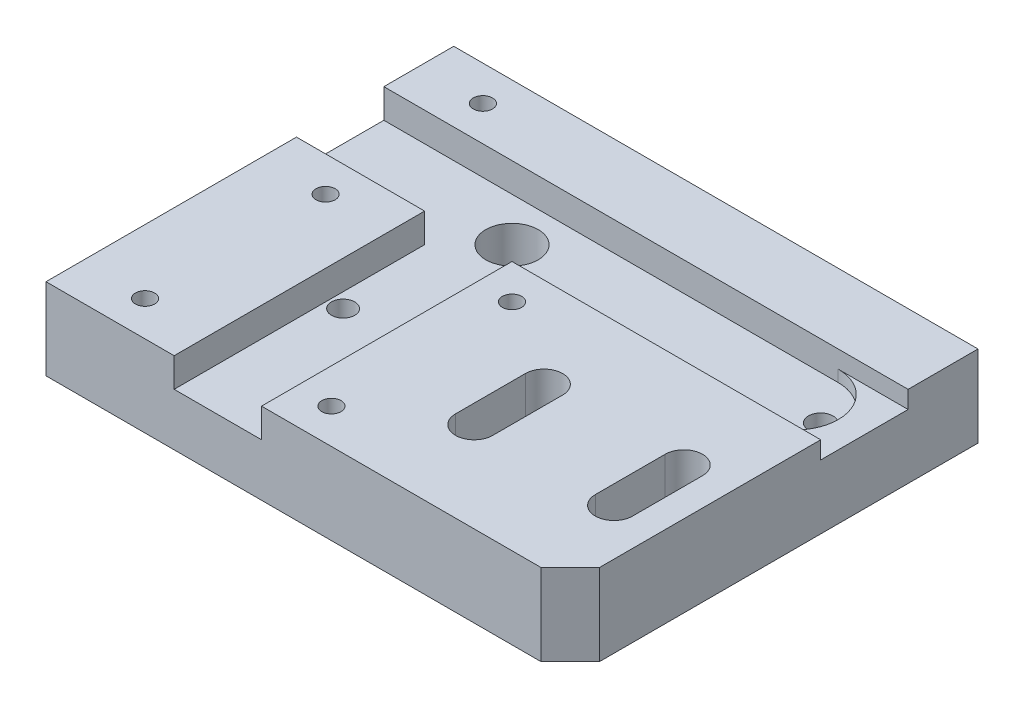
ISO-10303-21;
HEADER;
FILE_DESCRIPTION(('STEP AP214'),'2;1');
FILE_NAME('part.step','',(''),(''),'','','');
FILE_SCHEMA(('AUTOMOTIVE_DESIGN { 1 0 10303 214 1 1 1 1 }'));
ENDSEC;
DATA;
#1=APPLICATION_CONTEXT('core data for automotive mechanical design processes');
#2=APPLICATION_PROTOCOL_DEFINITION('international standard','automotive_design',2000,#1);
#3=PRODUCT_CONTEXT('',#1,'mechanical');
#4=PRODUCT('Part','Part','',(#3));
#5=PRODUCT_RELATED_PRODUCT_CATEGORY('part','',(#4));
#6=PRODUCT_DEFINITION_FORMATION('','',#4);
#7=PRODUCT_DEFINITION_CONTEXT('part definition',#1,'design');
#8=PRODUCT_DEFINITION('design','',#6,#7);
#9=PRODUCT_DEFINITION_SHAPE('','',#8);
#10=(LENGTH_UNIT() NAMED_UNIT(*) SI_UNIT(.MILLI.,.METRE.));
#11=(NAMED_UNIT(*) PLANE_ANGLE_UNIT() SI_UNIT($,.RADIAN.));
#12=(NAMED_UNIT(*) SI_UNIT($,.STERADIAN.) SOLID_ANGLE_UNIT());
#13=UNCERTAINTY_MEASURE_WITH_UNIT(LENGTH_MEASURE(1.E-05),#10,'distance_accuracy_value','');
#14=(GEOMETRIC_REPRESENTATION_CONTEXT(3) GLOBAL_UNCERTAINTY_ASSIGNED_CONTEXT((#13)) GLOBAL_UNIT_ASSIGNED_CONTEXT((#10,
#11,#12)) REPRESENTATION_CONTEXT('',''));
#15=CARTESIAN_POINT('',(0.,0.,0.));
#16=DIRECTION('',(0.,0.,1.));
#17=DIRECTION('',(1.,0.,0.));
#18=AXIS2_PLACEMENT_3D('',#15,#16,#17);
#19=CARTESIAN_POINT('',(28.,9.,-10.5));
#20=DIRECTION('',(0.,1.,0.));
#21=DIRECTION('',(0.,0.,1.));
#22=AXIS2_PLACEMENT_3D('',#19,#20,#21);
#23=CYLINDRICAL_SURFACE('',#22,7.5);
#24=CARTESIAN_POINT('',(28.,11.,-10.5));
#25=DIRECTION('',(0.,1.,0.));
#26=DIRECTION('',(0.,0.,1.));
#27=AXIS2_PLACEMENT_3D('',#24,#25,#26);
#28=CIRCLE('',#27,7.5);
#29=CARTESIAN_POINT('',(28.,11.,-3.00000000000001));
#30=VERTEX_POINT('',#29);
#31=CARTESIAN_POINT('',(28.,11.,-18.));
#32=VERTEX_POINT('',#31);
#33=EDGE_CURVE('E194',#30,#32,#28,.T.);
#34=ORIENTED_EDGE('',*,*,#33,.T.);
#35=DIRECTION('',(0.,1.,0.));
#36=VECTOR('',#35,1.);
#37=CARTESIAN_POINT('',(28.,9.,-18.));
#38=LINE('',#37,#36);
#39=CARTESIAN_POINT('',(28.,9.,-18.));
#40=VERTEX_POINT('',#39);
#41=EDGE_CURVE('E188',#32,#40,#38,.F.);
#42=ORIENTED_EDGE('',*,*,#41,.T.);
#43=CARTESIAN_POINT('',(28.,9.,-10.5));
#44=DIRECTION('',(0.,1.,0.));
#45=DIRECTION('',(0.,0.,1.));
#46=AXIS2_PLACEMENT_3D('',#43,#44,#45);
#47=CIRCLE('',#46,7.5);
#48=CARTESIAN_POINT('',(28.,9.,-3.00000000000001));
#49=VERTEX_POINT('',#48);
#50=EDGE_CURVE('E20',#40,#49,#47,.F.);
#51=ORIENTED_EDGE('',*,*,#50,.T.);
#52=DIRECTION('',(0.,1.,0.));
#53=VECTOR('',#52,1.);
#54=CARTESIAN_POINT('',(28.,9.,-3.00000000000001));
#55=LINE('',#54,#53);
#56=EDGE_CURVE('E228',#49,#30,#55,.T.);
#57=ORIENTED_EDGE('',*,*,#56,.T.);
#58=EDGE_LOOP('',(#34,#42,#51,#57));
#59=FACE_BOUND('',#58,.T.);
#60=ADVANCED_FACE('F17',(#59),#23,.F.);
#61=CARTESIAN_POINT('',(-40.,9.,-3.00000000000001));
#62=DIRECTION('',(0.,0.,1.));
#63=DIRECTION('',(1.,0.,0.));
#64=AXIS2_PLACEMENT_3D('',#61,#62,#63);
#65=PLANE('',#64);
#66=DIRECTION('',(0.,1.,0.));
#67=VECTOR('',#66,1.);
#68=CARTESIAN_POINT('',(-50.,0.,-3.));
#69=LINE('',#68,#67);
#70=CARTESIAN_POINT('',(-50.,9.,-3.00000000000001));
#71=VERTEX_POINT('',#70);
#72=CARTESIAN_POINT('',(-50.,14.,-3.00000000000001));
#73=VERTEX_POINT('',#72);
#74=EDGE_CURVE('E207',#71,#73,#69,.T.);
#75=ORIENTED_EDGE('',*,*,#74,.T.);
#76=DIRECTION('',(1.,0.,0.));
#77=VECTOR('',#76,1.);
#78=CARTESIAN_POINT('',(0.,14.,-3.00000000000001));
#79=LINE('',#78,#77);
#80=CARTESIAN_POINT('',(-28.,14.,-3.00000000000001));
#81=VERTEX_POINT('',#80);
#82=EDGE_CURVE('E358',#81,#73,#79,.F.);
#83=ORIENTED_EDGE('',*,*,#82,.F.);
#84=DIRECTION('',(0.,1.,0.));
#85=VECTOR('',#84,1.);
#86=CARTESIAN_POINT('',(-28.,9.,-3.00000000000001));
#87=LINE('',#86,#85);
#88=CARTESIAN_POINT('',(-28.,9.,-3.00000000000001));
#89=VERTEX_POINT('',#88);
#90=EDGE_CURVE('E241',#81,#89,#87,.F.);
#91=ORIENTED_EDGE('',*,*,#90,.T.);
#92=DIRECTION('',(1.,0.,0.));
#93=VECTOR('',#92,1.);
#94=CARTESIAN_POINT('',(0.,9.,-3.00000000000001));
#95=LINE('',#94,#93);
#96=EDGE_CURVE('E183',#89,#71,#95,.F.);
#97=ORIENTED_EDGE('',*,*,#96,.T.);
#98=EDGE_LOOP('',(#75,#83,#91,#97));
#99=FACE_BOUND('',#98,.T.);
#100=ADVANCED_FACE('F585',(#99),#65,.F.);
#101=CARTESIAN_POINT('',(-13.,9.,30.));
#102=DIRECTION('',(1.,0.,0.));
#103=DIRECTION('',(0.,0.,-1.));
#104=AXIS2_PLACEMENT_3D('',#101,#102,#103);
#105=PLANE('',#104);
#106=DIRECTION('',(0.,1.,0.));
#107=VECTOR('',#106,1.);
#108=CARTESIAN_POINT('',(-13.,9.,-3.00000000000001));
#109=LINE('',#108,#107);
#110=CARTESIAN_POINT('',(-13.,14.,-3.00000000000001));
#111=VERTEX_POINT('',#110);
#112=CARTESIAN_POINT('',(-13.,9.,-3.00000000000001));
#113=VERTEX_POINT('',#112);
#114=EDGE_CURVE('E236',#111,#113,#109,.F.);
#115=ORIENTED_EDGE('',*,*,#114,.T.);
#116=DIRECTION('',(0.,0.,-1.));
#117=VECTOR('',#116,1.);
#118=CARTESIAN_POINT('',(-13.,9.,0.));
#119=LINE('',#118,#117);
#120=CARTESIAN_POINT('',(-13.,9.,40.));
#121=VERTEX_POINT('',#120);
#122=EDGE_CURVE('E182',#113,#121,#119,.F.);
#123=ORIENTED_EDGE('',*,*,#122,.T.);
#124=DIRECTION('',(0.,1.,0.));
#125=VECTOR('',#124,1.);
#126=CARTESIAN_POINT('',(-13.,0.,40.));
#127=LINE('',#126,#125);
#128=CARTESIAN_POINT('',(-13.,14.,40.));
#129=VERTEX_POINT('',#128);
#130=EDGE_CURVE('E259',#129,#121,#127,.F.);
#131=ORIENTED_EDGE('',*,*,#130,.F.);
#132=DIRECTION('',(0.,0.,1.));
#133=VECTOR('',#132,1.);
#134=CARTESIAN_POINT('',(-13.,14.,0.));
#135=LINE('',#134,#133);
#136=EDGE_CURVE('E252',#111,#129,#135,.T.);
#137=ORIENTED_EDGE('',*,*,#136,.F.);
#138=EDGE_LOOP('',(#115,#123,#131,#137));
#139=FACE_BOUND('',#138,.T.);
#140=ADVANCED_FACE('F583',(#139),#105,.F.);
#141=CARTESIAN_POINT('',(0.,9.,0.));
#142=DIRECTION('',(0.,-1.,0.));
#143=DIRECTION('',(0.,0.,-1.));
#144=AXIS2_PLACEMENT_3D('',#141,#142,#143);
#145=PLANE('',#144);
#146=DIRECTION('',(1.,0.,0.));
#147=VECTOR('',#146,1.);
#148=CARTESIAN_POINT('',(0.,9.,40.));
#149=LINE('',#148,#147);
#150=CARTESIAN_POINT('',(-28.,9.,40.));
#151=VERTEX_POINT('',#150);
#152=EDGE_CURVE('E261',#121,#151,#149,.F.);
#153=ORIENTED_EDGE('',*,*,#152,.F.);
#154=ORIENTED_EDGE('',*,*,#122,.F.);
#155=DIRECTION('',(1.,0.,0.));
#156=VECTOR('',#155,1.);
#157=CARTESIAN_POINT('',(-40.,9.,-3.00000000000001));
#158=LINE('',#157,#156);
#159=EDGE_CURVE('E177',#113,#49,#158,.T.);
#160=ORIENTED_EDGE('',*,*,#159,.T.);
#161=ORIENTED_EDGE('',*,*,#50,.F.);
#162=DIRECTION('',(-1.,0.,0.));
#163=VECTOR('',#162,1.);
#164=CARTESIAN_POINT('',(-40.,9.,-18.));
#165=LINE('',#164,#163);
#166=CARTESIAN_POINT('',(-50.,9.,-18.));
#167=VERTEX_POINT('',#166);
#168=EDGE_CURVE('E174',#40,#167,#165,.T.);
#169=ORIENTED_EDGE('',*,*,#168,.T.);
#170=DIRECTION('',(0.,0.,-1.));
#171=VECTOR('',#170,1.);
#172=CARTESIAN_POINT('',(-50.,9.,0.));
#173=LINE('',#172,#171);
#174=EDGE_CURVE('E205',#167,#71,#173,.F.);
#175=ORIENTED_EDGE('',*,*,#174,.T.);
#176=ORIENTED_EDGE('',*,*,#96,.F.);
#177=DIRECTION('',(0.,0.,1.));
#178=VECTOR('',#177,1.);
#179=CARTESIAN_POINT('',(-28.,9.,30.));
#180=LINE('',#179,#178);
#181=EDGE_CURVE('E360',#89,#151,#180,.T.);
#182=ORIENTED_EDGE('',*,*,#181,.T.);
#183=EDGE_LOOP('',(#153,#154,#160,#161,#169,#175,#176,#182));
#184=FACE_BOUND('',#183,.T.);
#185=CARTESIAN_POINT('',(-20.5,9.,-10.5));
#186=DIRECTION('',(0.,1.,0.));
#187=DIRECTION('',(0.,0.,1.));
#188=AXIS2_PLACEMENT_3D('',#185,#186,#187);
#189=CIRCLE('',#188,4.5);
#190=CARTESIAN_POINT('',(-20.5,9.,-6.));
#191=VERTEX_POINT('',#190);
#192=EDGE_CURVE('E309',#191,#191,#189,.F.);
#193=ORIENTED_EDGE('',*,*,#192,.T.);
#194=EDGE_LOOP('',(#193));
#195=FACE_BOUND('',#194,.T.);
#196=CARTESIAN_POINT('',(32.5,9.,-10.5));
#197=DIRECTION('',(0.,1.,0.));
#198=DIRECTION('',(0.,0.,1.));
#199=AXIS2_PLACEMENT_3D('',#196,#197,#198);
#200=CIRCLE('',#199,2.1);
#201=CARTESIAN_POINT('',(32.5,9.,-8.4));
#202=VERTEX_POINT('',#201);
#203=EDGE_CURVE('E328',#202,#202,#200,.F.);
#204=ORIENTED_EDGE('',*,*,#203,.T.);
#205=EDGE_LOOP('',(#204));
#206=FACE_BOUND('',#205,.T.);
#207=CARTESIAN_POINT('',(-25.5,9.,13.5));
#208=DIRECTION('',(0.,1.,0.));
#209=DIRECTION('',(0.,0.,1.));
#210=AXIS2_PLACEMENT_3D('',#207,#208,#209);
#211=CIRCLE('',#210,2.);
#212=CARTESIAN_POINT('',(-25.5,9.,15.5));
#213=VERTEX_POINT('',#212);
#214=EDGE_CURVE('E256',#213,#213,#211,.F.);
#215=ORIENTED_EDGE('',*,*,#214,.T.);
#216=EDGE_LOOP('',(#215));
#217=FACE_BOUND('',#216,.T.);
#218=ADVANCED_FACE('F171',(#184,#195,#206,#217),#145,.F.);
#219=CARTESIAN_POINT('',(-28.,9.,30.));
#220=DIRECTION('',(-1.,0.,0.));
#221=DIRECTION('',(0.,0.,1.));
#222=AXIS2_PLACEMENT_3D('',#219,#220,#221);
#223=PLANE('',#222);
#224=DIRECTION('',(0.,1.,0.));
#225=VECTOR('',#224,1.);
#226=CARTESIAN_POINT('',(-28.,0.,40.));
#227=LINE('',#226,#225);
#228=CARTESIAN_POINT('',(-28.,14.,40.));
#229=VERTEX_POINT('',#228);
#230=EDGE_CURVE('E266',#151,#229,#227,.T.);
#231=ORIENTED_EDGE('',*,*,#230,.F.);
#232=ORIENTED_EDGE('',*,*,#181,.F.);
#233=ORIENTED_EDGE('',*,*,#90,.F.);
#234=DIRECTION('',(0.,0.,1.));
#235=VECTOR('',#234,1.);
#236=CARTESIAN_POINT('',(-28.,14.,0.));
#237=LINE('',#236,#235);
#238=EDGE_CURVE('E246',#229,#81,#237,.F.);
#239=ORIENTED_EDGE('',*,*,#238,.F.);
#240=EDGE_LOOP('',(#231,#232,#233,#239));
#241=FACE_BOUND('',#240,.T.);
#242=ADVANCED_FACE('F576',(#241),#223,.F.);
#243=CARTESIAN_POINT('',(0.,14.,0.));
#244=DIRECTION('',(0.,1.,0.));
#245=DIRECTION('',(0.,0.,1.));
#246=AXIS2_PLACEMENT_3D('',#243,#244,#245);
#247=PLANE('',#246);
#248=DIRECTION('',(1.,0.,0.));
#249=VECTOR('',#248,1.);
#250=CARTESIAN_POINT('',(0.,14.,40.));
#251=LINE('',#250,#249);
#252=CARTESIAN_POINT('',(-50.,14.,40.));
#253=VERTEX_POINT('',#252);
#254=EDGE_CURVE('E421',#229,#253,#251,.F.);
#255=ORIENTED_EDGE('',*,*,#254,.F.);
#256=ORIENTED_EDGE('',*,*,#238,.T.);
#257=ORIENTED_EDGE('',*,*,#82,.T.);
#258=DIRECTION('',(0.,0.,-1.));
#259=VECTOR('',#258,1.);
#260=CARTESIAN_POINT('',(-50.,14.,0.));
#261=LINE('',#260,#259);
#262=EDGE_CURVE('E429',#73,#253,#261,.F.);
#263=ORIENTED_EDGE('',*,*,#262,.T.);
#264=EDGE_LOOP('',(#255,#256,#257,#263));
#265=FACE_BOUND('',#264,.T.);
#266=CARTESIAN_POINT('',(-39.,14.,2.99999999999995));
#267=DIRECTION('',(0.,1.,0.));
#268=DIRECTION('',(0.,0.,1.));
#269=AXIS2_PLACEMENT_3D('',#266,#267,#268);
#270=CIRCLE('',#269,1.64999999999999);
#271=CARTESIAN_POINT('',(-39.,14.,4.64999999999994));
#272=VERTEX_POINT('',#271);
#273=EDGE_CURVE('E322',#272,#272,#270,.F.);
#274=ORIENTED_EDGE('',*,*,#273,.T.);
#275=EDGE_LOOP('',(#274));
#276=FACE_BOUND('',#275,.T.);
#277=CARTESIAN_POINT('',(-39.,14.,34.));
#278=DIRECTION('',(0.,1.,0.));
#279=DIRECTION('',(0.,0.,1.));
#280=AXIS2_PLACEMENT_3D('',#277,#278,#279);
#281=CIRCLE('',#280,1.64999999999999);
#282=CARTESIAN_POINT('',(-39.,14.,35.65));
#283=VERTEX_POINT('',#282);
#284=EDGE_CURVE('E325',#283,#283,#281,.F.);
#285=ORIENTED_EDGE('',*,*,#284,.T.);
#286=EDGE_LOOP('',(#285));
#287=FACE_BOUND('',#286,.T.);
#288=ADVANCED_FACE('F573',(#265,#276,#287),#247,.T.);
#289=CARTESIAN_POINT('',(-40.,9.,-3.00000000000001));
#290=DIRECTION('',(0.,0.,1.));
#291=DIRECTION('',(1.,0.,0.));
#292=AXIS2_PLACEMENT_3D('',#289,#290,#291);
#293=PLANE('',#292);
#294=DIRECTION('',(0.,1.,0.));
#295=VECTOR('',#294,1.);
#296=CARTESIAN_POINT('',(40.,14.,-3.00000000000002));
#297=LINE('',#296,#295);
#298=CARTESIAN_POINT('',(40.,14.,-3.00000000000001));
#299=VERTEX_POINT('',#298);
#300=CARTESIAN_POINT('',(40.,11.,-3.00000000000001));
#301=VERTEX_POINT('',#300);
#302=EDGE_CURVE('E225',#299,#301,#297,.F.);
#303=ORIENTED_EDGE('',*,*,#302,.T.);
#304=DIRECTION('',(1.,0.,0.));
#305=VECTOR('',#304,1.);
#306=CARTESIAN_POINT('',(0.,11.,-3.00000000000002));
#307=LINE('',#306,#305);
#308=EDGE_CURVE('E197',#301,#30,#307,.F.);
#309=ORIENTED_EDGE('',*,*,#308,.T.);
#310=ORIENTED_EDGE('',*,*,#56,.F.);
#311=ORIENTED_EDGE('',*,*,#159,.F.);
#312=ORIENTED_EDGE('',*,*,#114,.F.);
#313=DIRECTION('',(1.,0.,0.));
#314=VECTOR('',#313,1.);
#315=CARTESIAN_POINT('',(0.,14.,-3.00000000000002));
#316=LINE('',#315,#314);
#317=EDGE_CURVE('E249',#299,#111,#316,.F.);
#318=ORIENTED_EDGE('',*,*,#317,.F.);
#319=EDGE_LOOP('',(#303,#309,#310,#311,#312,#318));
#320=FACE_BOUND('',#319,.T.);
#321=ADVANCED_FACE('F569',(#320),#293,.F.);
#322=CARTESIAN_POINT('',(0.,11.,0.));
#323=DIRECTION('',(0.,-1.,0.));
#324=DIRECTION('',(0.,0.,-1.));
#325=AXIS2_PLACEMENT_3D('',#322,#323,#324);
#326=PLANE('',#325);
#327=DIRECTION('',(0.,0.,1.));
#328=VECTOR('',#327,1.);
#329=CARTESIAN_POINT('',(40.,11.,-30.));
#330=LINE('',#329,#328);
#331=CARTESIAN_POINT('',(40.,11.,-18.));
#332=VERTEX_POINT('',#331);
#333=EDGE_CURVE('E220',#301,#332,#330,.F.);
#334=ORIENTED_EDGE('',*,*,#333,.T.);
#335=DIRECTION('',(-1.,0.,0.));
#336=VECTOR('',#335,1.);
#337=CARTESIAN_POINT('',(-40.,11.,-18.));
#338=LINE('',#337,#336);
#339=EDGE_CURVE('E195',#332,#32,#338,.T.);
#340=ORIENTED_EDGE('',*,*,#339,.T.);
#341=ORIENTED_EDGE('',*,*,#33,.F.);
#342=ORIENTED_EDGE('',*,*,#308,.F.);
#343=EDGE_LOOP('',(#334,#340,#341,#342));
#344=FACE_BOUND('',#343,.T.);
#345=ADVANCED_FACE('F566',(#344),#326,.F.);
#346=CARTESIAN_POINT('',(-40.,9.,-18.));
#347=DIRECTION('',(0.,0.,-1.));
#348=DIRECTION('',(-1.,0.,0.));
#349=AXIS2_PLACEMENT_3D('',#346,#347,#348);
#350=PLANE('',#349);
#351=DIRECTION('',(0.,1.,0.));
#352=VECTOR('',#351,1.);
#353=CARTESIAN_POINT('',(-50.,0.,-18.));
#354=LINE('',#353,#352);
#355=CARTESIAN_POINT('',(-50.,14.,-18.));
#356=VERTEX_POINT('',#355);
#357=EDGE_CURVE('E191',#356,#167,#354,.F.);
#358=ORIENTED_EDGE('',*,*,#357,.T.);
#359=ORIENTED_EDGE('',*,*,#168,.F.);
#360=ORIENTED_EDGE('',*,*,#41,.F.);
#361=ORIENTED_EDGE('',*,*,#339,.F.);
#362=DIRECTION('',(0.,1.,0.));
#363=VECTOR('',#362,1.);
#364=CARTESIAN_POINT('',(40.,14.,-18.));
#365=LINE('',#364,#363);
#366=CARTESIAN_POINT('',(40.,14.,-18.));
#367=VERTEX_POINT('',#366);
#368=EDGE_CURVE('E216',#332,#367,#365,.T.);
#369=ORIENTED_EDGE('',*,*,#368,.T.);
#370=DIRECTION('',(1.,0.,0.));
#371=VECTOR('',#370,1.);
#372=CARTESIAN_POINT('',(0.,14.,-18.));
#373=LINE('',#372,#371);
#374=EDGE_CURVE('E192',#356,#367,#373,.T.);
#375=ORIENTED_EDGE('',*,*,#374,.F.);
#376=EDGE_LOOP('',(#358,#359,#360,#361,#369,#375));
#377=FACE_BOUND('',#376,.T.);
#378=ADVANCED_FACE('F187',(#377),#350,.F.);
#379=CARTESIAN_POINT('',(0.,14.,0.));
#380=DIRECTION('',(0.,1.,0.));
#381=DIRECTION('',(0.,0.,1.));
#382=AXIS2_PLACEMENT_3D('',#379,#380,#381);
#383=PLANE('',#382);
#384=DIRECTION('',(1.,0.,0.));
#385=VECTOR('',#384,1.);
#386=CARTESIAN_POINT('',(-40.,14.,-30.));
#387=LINE('',#386,#385);
#388=CARTESIAN_POINT('',(40.,14.,-30.));
#389=VERTEX_POINT('',#388);
#390=CARTESIAN_POINT('',(-50.,14.,-30.));
#391=VERTEX_POINT('',#390);
#392=EDGE_CURVE('E312',#389,#391,#387,.F.);
#393=ORIENTED_EDGE('',*,*,#392,.T.);
#394=DIRECTION('',(0.,0.,-1.));
#395=VECTOR('',#394,1.);
#396=CARTESIAN_POINT('',(-50.,14.,0.));
#397=LINE('',#396,#395);
#398=EDGE_CURVE('E211',#391,#356,#397,.F.);
#399=ORIENTED_EDGE('',*,*,#398,.T.);
#400=ORIENTED_EDGE('',*,*,#374,.T.);
#401=DIRECTION('',(0.,0.,1.));
#402=VECTOR('',#401,1.);
#403=CARTESIAN_POINT('',(40.,14.,-30.));
#404=LINE('',#403,#402);
#405=EDGE_CURVE('E219',#367,#389,#404,.F.);
#406=ORIENTED_EDGE('',*,*,#405,.T.);
#407=EDGE_LOOP('',(#393,#399,#400,#406));
#408=FACE_BOUND('',#407,.T.);
#409=CARTESIAN_POINT('',(-39.,14.,-24.));
#410=DIRECTION('',(0.,1.,0.));
#411=DIRECTION('',(0.,0.,1.));
#412=AXIS2_PLACEMENT_3D('',#409,#410,#411);
#413=CIRCLE('',#412,1.64999999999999);
#414=CARTESIAN_POINT('',(-39.,14.,-22.3500000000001));
#415=VERTEX_POINT('',#414);
#416=EDGE_CURVE('E319',#415,#415,#413,.F.);
#417=ORIENTED_EDGE('',*,*,#416,.T.);
#418=EDGE_LOOP('',(#417));
#419=FACE_BOUND('',#418,.T.);
#420=ADVANCED_FACE('F559',(#408,#419),#383,.T.);
#421=CARTESIAN_POINT('',(0.,14.,0.));
#422=DIRECTION('',(0.,1.,0.));
#423=DIRECTION('',(0.,0.,1.));
#424=AXIS2_PLACEMENT_3D('',#421,#422,#423);
#425=PLANE('',#424);
#426=ORIENTED_EDGE('',*,*,#317,.T.);
#427=ORIENTED_EDGE('',*,*,#136,.T.);
#428=DIRECTION('',(1.,0.,0.));
#429=VECTOR('',#428,1.);
#430=CARTESIAN_POINT('',(0.,14.,40.));
#431=LINE('',#430,#429);
#432=CARTESIAN_POINT('',(35.,14.,40.));
#433=VERTEX_POINT('',#432);
#434=EDGE_CURVE('E262',#433,#129,#431,.F.);
#435=ORIENTED_EDGE('',*,*,#434,.F.);
#436=DIRECTION('',(0.707106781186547,0.,-0.707106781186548));
#437=VECTOR('',#436,1.);
#438=CARTESIAN_POINT('',(35.,14.,40.));
#439=LINE('',#438,#437);
#440=CARTESIAN_POINT('',(40.,14.,35.));
#441=VERTEX_POINT('',#440);
#442=EDGE_CURVE('E417',#441,#433,#439,.F.);
#443=ORIENTED_EDGE('',*,*,#442,.F.);
#444=DIRECTION('',(0.,0.,1.));
#445=VECTOR('',#444,1.);
#446=CARTESIAN_POINT('',(40.,14.,-30.));
#447=LINE('',#446,#445);
#448=EDGE_CURVE('E308',#441,#299,#447,.F.);
#449=ORIENTED_EDGE('',*,*,#448,.T.);
#450=EDGE_LOOP('',(#426,#427,#435,#443,#449));
#451=FACE_BOUND('',#450,.T.);
#452=CARTESIAN_POINT('',(-6.99999999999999,14.,34.));
#453=DIRECTION('',(0.,1.,0.));
#454=DIRECTION('',(0.,0.,1.));
#455=AXIS2_PLACEMENT_3D('',#452,#453,#454);
#456=CIRCLE('',#455,1.64999999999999);
#457=CARTESIAN_POINT('',(-6.99999999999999,14.,35.65));
#458=VERTEX_POINT('',#457);
#459=EDGE_CURVE('E313',#458,#458,#456,.F.);
#460=ORIENTED_EDGE('',*,*,#459,.T.);
#461=EDGE_LOOP('',(#460));
#462=FACE_BOUND('',#461,.T.);
#463=CARTESIAN_POINT('',(-6.99999999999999,14.,2.99999999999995));
#464=DIRECTION('',(0.,1.,0.));
#465=DIRECTION('',(0.,0.,1.));
#466=AXIS2_PLACEMENT_3D('',#463,#464,#465);
#467=CIRCLE('',#466,1.64999999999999);
#468=CARTESIAN_POINT('',(-6.99999999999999,14.,4.64999999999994));
#469=VERTEX_POINT('',#468);
#470=EDGE_CURVE('E316',#469,#469,#467,.F.);
#471=ORIENTED_EDGE('',*,*,#470,.T.);
#472=EDGE_LOOP('',(#471));
#473=FACE_BOUND('',#472,.T.);
#474=DIRECTION('',(0.,0.,-1.));
#475=VECTOR('',#474,1.);
#476=CARTESIAN_POINT('',(11.2,14.,24.5));
#477=LINE('',#476,#475);
#478=CARTESIAN_POINT('',(11.2,14.,12.5));
#479=VERTEX_POINT('',#478);
#480=CARTESIAN_POINT('',(11.2,14.,24.5));
#481=VERTEX_POINT('',#480);
#482=EDGE_CURVE('E369',#479,#481,#477,.F.);
#483=ORIENTED_EDGE('',*,*,#482,.T.);
#484=CARTESIAN_POINT('',(8.00000000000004,14.,24.5));
#485=DIRECTION('',(0.,1.,0.));
#486=DIRECTION('',(0.,0.,1.));
#487=AXIS2_PLACEMENT_3D('',#484,#485,#486);
#488=CIRCLE('',#487,3.2);
#489=CARTESIAN_POINT('',(4.80000000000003,14.,24.5));
#490=VERTEX_POINT('',#489);
#491=EDGE_CURVE('E332',#481,#490,#488,.F.);
#492=ORIENTED_EDGE('',*,*,#491,.T.);
#493=DIRECTION('',(0.,0.,1.));
#494=VECTOR('',#493,1.);
#495=CARTESIAN_POINT('',(4.80000000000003,14.,24.5));
#496=LINE('',#495,#494);
#497=CARTESIAN_POINT('',(4.80000000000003,14.,12.5));
#498=VERTEX_POINT('',#497);
#499=EDGE_CURVE('E331',#490,#498,#496,.F.);
#500=ORIENTED_EDGE('',*,*,#499,.T.);
#501=CARTESIAN_POINT('',(8.00000000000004,14.,12.5));
#502=DIRECTION('',(0.,1.,0.));
#503=DIRECTION('',(0.,0.,1.));
#504=AXIS2_PLACEMENT_3D('',#501,#502,#503);
#505=CIRCLE('',#504,3.2);
#506=EDGE_CURVE('E336',#498,#479,#505,.F.);
#507=ORIENTED_EDGE('',*,*,#506,.T.);
#508=EDGE_LOOP('',(#483,#492,#500,#507));
#509=FACE_BOUND('',#508,.T.);
#510=DIRECTION('',(0.,0.,-1.));
#511=VECTOR('',#510,1.);
#512=CARTESIAN_POINT('',(35.2,14.,24.5));
#513=LINE('',#512,#511);
#514=CARTESIAN_POINT('',(35.2,14.,12.5));
#515=VERTEX_POINT('',#514);
#516=CARTESIAN_POINT('',(35.2,14.,24.5));
#517=VERTEX_POINT('',#516);
#518=EDGE_CURVE('E200',#515,#517,#513,.F.);
#519=ORIENTED_EDGE('',*,*,#518,.T.);
#520=CARTESIAN_POINT('',(32.,14.,24.5));
#521=DIRECTION('',(0.,1.,0.));
#522=DIRECTION('',(0.,0.,1.));
#523=AXIS2_PLACEMENT_3D('',#520,#521,#522);
#524=CIRCLE('',#523,3.2);
#525=CARTESIAN_POINT('',(28.8,14.,24.5));
#526=VERTEX_POINT('',#525);
#527=EDGE_CURVE('E340',#517,#526,#524,.F.);
#528=ORIENTED_EDGE('',*,*,#527,.T.);
#529=DIRECTION('',(0.,0.,1.));
#530=VECTOR('',#529,1.);
#531=CARTESIAN_POINT('',(28.8,14.,24.5));
#532=LINE('',#531,#530);
#533=CARTESIAN_POINT('',(28.8,14.,12.5));
#534=VERTEX_POINT('',#533);
#535=EDGE_CURVE('E339',#526,#534,#532,.F.);
#536=ORIENTED_EDGE('',*,*,#535,.T.);
#537=CARTESIAN_POINT('',(32.,14.,12.5));
#538=DIRECTION('',(0.,1.,0.));
#539=DIRECTION('',(0.,0.,1.));
#540=AXIS2_PLACEMENT_3D('',#537,#538,#539);
#541=CIRCLE('',#540,3.2);
#542=EDGE_CURVE('E344',#534,#515,#541,.F.);
#543=ORIENTED_EDGE('',*,*,#542,.T.);
#544=EDGE_LOOP('',(#519,#528,#536,#543));
#545=FACE_BOUND('',#544,.T.);
#546=ADVANCED_FACE('F389',(#451,#462,#473,#509,#545),#425,.T.);
#547=CARTESIAN_POINT('',(-25.5,0.,13.5));
#548=DIRECTION('',(0.,1.,0.));
#549=DIRECTION('',(0.,0.,1.));
#550=AXIS2_PLACEMENT_3D('',#547,#548,#549);
#551=CYLINDRICAL_SURFACE('',#550,2.);
#552=CARTESIAN_POINT('',(-25.5,0.,13.5));
#553=DIRECTION('',(0.,1.,0.));
#554=DIRECTION('',(0.,0.,1.));
#555=AXIS2_PLACEMENT_3D('',#552,#553,#554);
#556=CIRCLE('',#555,2.);
#557=CARTESIAN_POINT('',(-25.5,0.,15.5));
#558=VERTEX_POINT('',#557);
#559=EDGE_CURVE('E305',#558,#558,#556,.F.);
#560=ORIENTED_EDGE('',*,*,#559,.T.);
#561=EDGE_LOOP('',(#560));
#562=FACE_BOUND('',#561,.T.);
#563=ORIENTED_EDGE('',*,*,#214,.F.);
#564=EDGE_LOOP('',(#563));
#565=FACE_BOUND('',#564,.T.);
#566=ADVANCED_FACE('F553',(#562,#565),#551,.F.);
#567=CARTESIAN_POINT('',(32.,0.,12.5));
#568=DIRECTION('',(0.,1.,0.));
#569=DIRECTION('',(0.,0.,1.));
#570=AXIS2_PLACEMENT_3D('',#567,#568,#569);
#571=CYLINDRICAL_SURFACE('',#570,3.2);
#572=DIRECTION('',(0.,1.,0.));
#573=VECTOR('',#572,1.);
#574=CARTESIAN_POINT('',(28.8,0.,12.5));
#575=LINE('',#574,#573);
#576=CARTESIAN_POINT('',(28.8,0.,12.5));
#577=VERTEX_POINT('',#576);
#578=EDGE_CURVE('E342',#534,#577,#575,.F.);
#579=ORIENTED_EDGE('',*,*,#578,.T.);
#580=CARTESIAN_POINT('',(32.,0.,12.5));
#581=DIRECTION('',(0.,1.,0.));
#582=DIRECTION('',(0.,0.,1.));
#583=AXIS2_PLACEMENT_3D('',#580,#581,#582);
#584=CIRCLE('',#583,3.2);
#585=CARTESIAN_POINT('',(35.2,0.,12.5));
#586=VERTEX_POINT('',#585);
#587=EDGE_CURVE('E302',#577,#586,#584,.F.);
#588=ORIENTED_EDGE('',*,*,#587,.T.);
#589=DIRECTION('',(0.,1.,0.));
#590=VECTOR('',#589,1.);
#591=CARTESIAN_POINT('',(35.2,0.,12.5));
#592=LINE('',#591,#590);
#593=EDGE_CURVE('E346',#586,#515,#592,.T.);
#594=ORIENTED_EDGE('',*,*,#593,.T.);
#595=ORIENTED_EDGE('',*,*,#542,.F.);
#596=EDGE_LOOP('',(#579,#588,#594,#595));
#597=FACE_BOUND('',#596,.T.);
#598=ADVANCED_FACE('F550',(#597),#571,.F.);
#599=CARTESIAN_POINT('',(35.2,0.,24.5));
#600=DIRECTION('',(1.,0.,0.));
#601=DIRECTION('',(0.,0.,-1.));
#602=AXIS2_PLACEMENT_3D('',#599,#600,#601);
#603=PLANE('',#602);
#604=ORIENTED_EDGE('',*,*,#593,.F.);
#605=DIRECTION('',(0.,0.,1.));
#606=VECTOR('',#605,1.);
#607=CARTESIAN_POINT('',(35.2,0.,0.));
#608=LINE('',#607,#606);
#609=CARTESIAN_POINT('',(35.2,0.,24.5));
#610=VERTEX_POINT('',#609);
#611=EDGE_CURVE('E301',#586,#610,#608,.T.);
#612=ORIENTED_EDGE('',*,*,#611,.T.);
#613=DIRECTION('',(0.,1.,0.));
#614=VECTOR('',#613,1.);
#615=CARTESIAN_POINT('',(35.2,0.,24.5));
#616=LINE('',#615,#614);
#617=EDGE_CURVE('E343',#610,#517,#616,.T.);
#618=ORIENTED_EDGE('',*,*,#617,.T.);
#619=ORIENTED_EDGE('',*,*,#518,.F.);
#620=EDGE_LOOP('',(#604,#612,#618,#619));
#621=FACE_BOUND('',#620,.T.);
#622=ADVANCED_FACE('F392',(#621),#603,.F.);
#623=CARTESIAN_POINT('',(32.,0.,24.5));
#624=DIRECTION('',(0.,1.,0.));
#625=DIRECTION('',(0.,0.,1.));
#626=AXIS2_PLACEMENT_3D('',#623,#624,#625);
#627=CYLINDRICAL_SURFACE('',#626,3.2);
#628=CARTESIAN_POINT('',(32.,0.,24.5));
#629=DIRECTION('',(0.,1.,0.));
#630=DIRECTION('',(0.,0.,1.));
#631=AXIS2_PLACEMENT_3D('',#628,#629,#630);
#632=CIRCLE('',#631,3.2);
#633=CARTESIAN_POINT('',(28.8,0.,24.5));
#634=VERTEX_POINT('',#633);
#635=EDGE_CURVE('E299',#610,#634,#632,.F.);
#636=ORIENTED_EDGE('',*,*,#635,.T.);
#637=DIRECTION('',(0.,1.,0.));
#638=VECTOR('',#637,1.);
#639=CARTESIAN_POINT('',(28.8,0.,24.5));
#640=LINE('',#639,#638);
#641=EDGE_CURVE('E372',#634,#526,#640,.T.);
#642=ORIENTED_EDGE('',*,*,#641,.T.);
#643=ORIENTED_EDGE('',*,*,#527,.F.);
#644=ORIENTED_EDGE('',*,*,#617,.F.);
#645=EDGE_LOOP('',(#636,#642,#643,#644));
#646=FACE_BOUND('',#645,.T.);
#647=ADVANCED_FACE('F395',(#646),#627,.F.);
#648=CARTESIAN_POINT('',(28.8,0.,24.5));
#649=DIRECTION('',(-1.,0.,0.));
#650=DIRECTION('',(0.,0.,1.));
#651=AXIS2_PLACEMENT_3D('',#648,#649,#650);
#652=PLANE('',#651);
#653=ORIENTED_EDGE('',*,*,#641,.F.);
#654=DIRECTION('',(0.,0.,1.));
#655=VECTOR('',#654,1.);
#656=CARTESIAN_POINT('',(28.8,0.,0.));
#657=LINE('',#656,#655);
#658=EDGE_CURVE('E298',#634,#577,#657,.F.);
#659=ORIENTED_EDGE('',*,*,#658,.T.);
#660=ORIENTED_EDGE('',*,*,#578,.F.);
#661=ORIENTED_EDGE('',*,*,#535,.F.);
#662=EDGE_LOOP('',(#653,#659,#660,#661));
#663=FACE_BOUND('',#662,.T.);
#664=ADVANCED_FACE('F542',(#663),#652,.F.);
#665=CARTESIAN_POINT('',(8.00000000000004,0.,12.5));
#666=DIRECTION('',(0.,1.,0.));
#667=DIRECTION('',(0.,0.,1.));
#668=AXIS2_PLACEMENT_3D('',#665,#666,#667);
#669=CYLINDRICAL_SURFACE('',#668,3.2);
#670=DIRECTION('',(0.,1.,0.));
#671=VECTOR('',#670,1.);
#672=CARTESIAN_POINT('',(4.80000000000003,0.,12.5));
#673=LINE('',#672,#671);
#674=CARTESIAN_POINT('',(4.80000000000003,0.,12.5));
#675=VERTEX_POINT('',#674);
#676=EDGE_CURVE('E334',#498,#675,#673,.F.);
#677=ORIENTED_EDGE('',*,*,#676,.T.);
#678=CARTESIAN_POINT('',(8.00000000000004,0.,12.5));
#679=DIRECTION('',(0.,1.,0.));
#680=DIRECTION('',(0.,0.,1.));
#681=AXIS2_PLACEMENT_3D('',#678,#679,#680);
#682=CIRCLE('',#681,3.2);
#683=CARTESIAN_POINT('',(11.2,0.,12.5));
#684=VERTEX_POINT('',#683);
#685=EDGE_CURVE('E295',#675,#684,#682,.F.);
#686=ORIENTED_EDGE('',*,*,#685,.T.);
#687=DIRECTION('',(0.,1.,0.));
#688=VECTOR('',#687,1.);
#689=CARTESIAN_POINT('',(11.2,0.,12.5));
#690=LINE('',#689,#688);
#691=EDGE_CURVE('E338',#684,#479,#690,.T.);
#692=ORIENTED_EDGE('',*,*,#691,.T.);
#693=ORIENTED_EDGE('',*,*,#506,.F.);
#694=EDGE_LOOP('',(#677,#686,#692,#693));
#695=FACE_BOUND('',#694,.T.);
#696=ADVANCED_FACE('F539',(#695),#669,.F.);
#697=CARTESIAN_POINT('',(11.2,0.,24.5));
#698=DIRECTION('',(1.,0.,0.));
#699=DIRECTION('',(0.,0.,-1.));
#700=AXIS2_PLACEMENT_3D('',#697,#698,#699);
#701=PLANE('',#700);
#702=ORIENTED_EDGE('',*,*,#691,.F.);
#703=DIRECTION('',(0.,0.,1.));
#704=VECTOR('',#703,1.);
#705=CARTESIAN_POINT('',(11.2,0.,0.));
#706=LINE('',#705,#704);
#707=CARTESIAN_POINT('',(11.2,0.,24.5));
#708=VERTEX_POINT('',#707);
#709=EDGE_CURVE('E294',#684,#708,#706,.T.);
#710=ORIENTED_EDGE('',*,*,#709,.T.);
#711=DIRECTION('',(0.,1.,0.));
#712=VECTOR('',#711,1.);
#713=CARTESIAN_POINT('',(11.2,0.,24.5));
#714=LINE('',#713,#712);
#715=EDGE_CURVE('E335',#708,#481,#714,.T.);
#716=ORIENTED_EDGE('',*,*,#715,.T.);
#717=ORIENTED_EDGE('',*,*,#482,.F.);
#718=EDGE_LOOP('',(#702,#710,#716,#717));
#719=FACE_BOUND('',#718,.T.);
#720=ADVANCED_FACE('F445',(#719),#701,.F.);
#721=CARTESIAN_POINT('',(8.00000000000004,0.,24.5));
#722=DIRECTION('',(0.,1.,0.));
#723=DIRECTION('',(0.,0.,1.));
#724=AXIS2_PLACEMENT_3D('',#721,#722,#723);
#725=CYLINDRICAL_SURFACE('',#724,3.2);
#726=CARTESIAN_POINT('',(8.00000000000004,0.,24.5));
#727=DIRECTION('',(0.,1.,0.));
#728=DIRECTION('',(0.,0.,1.));
#729=AXIS2_PLACEMENT_3D('',#726,#727,#728);
#730=CIRCLE('',#729,3.2);
#731=CARTESIAN_POINT('',(4.80000000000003,0.,24.5));
#732=VERTEX_POINT('',#731);
#733=EDGE_CURVE('E292',#708,#732,#730,.F.);
#734=ORIENTED_EDGE('',*,*,#733,.T.);
#735=DIRECTION('',(0.,1.,0.));
#736=VECTOR('',#735,1.);
#737=CARTESIAN_POINT('',(4.80000000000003,0.,24.5));
#738=LINE('',#737,#736);
#739=EDGE_CURVE('E368',#732,#490,#738,.T.);
#740=ORIENTED_EDGE('',*,*,#739,.T.);
#741=ORIENTED_EDGE('',*,*,#491,.F.);
#742=ORIENTED_EDGE('',*,*,#715,.F.);
#743=EDGE_LOOP('',(#734,#740,#741,#742));
#744=FACE_BOUND('',#743,.T.);
#745=ADVANCED_FACE('F450',(#744),#725,.F.);
#746=CARTESIAN_POINT('',(4.80000000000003,0.,24.5));
#747=DIRECTION('',(-1.,0.,0.));
#748=DIRECTION('',(0.,0.,1.));
#749=AXIS2_PLACEMENT_3D('',#746,#747,#748);
#750=PLANE('',#749);
#751=ORIENTED_EDGE('',*,*,#739,.F.);
#752=DIRECTION('',(0.,0.,1.));
#753=VECTOR('',#752,1.);
#754=CARTESIAN_POINT('',(4.80000000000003,0.,0.));
#755=LINE('',#754,#753);
#756=EDGE_CURVE('E291',#732,#675,#755,.F.);
#757=ORIENTED_EDGE('',*,*,#756,.T.);
#758=ORIENTED_EDGE('',*,*,#676,.F.);
#759=ORIENTED_EDGE('',*,*,#499,.F.);
#760=EDGE_LOOP('',(#751,#757,#758,#759));
#761=FACE_BOUND('',#760,.T.);
#762=ADVANCED_FACE('F531',(#761),#750,.F.);
#763=CARTESIAN_POINT('',(32.5,9.,-10.5));
#764=DIRECTION('',(0.,1.,0.));
#765=DIRECTION('',(0.,0.,1.));
#766=AXIS2_PLACEMENT_3D('',#763,#764,#765);
#767=CYLINDRICAL_SURFACE('',#766,2.1);
#768=CARTESIAN_POINT('',(32.5,0.,-10.5));
#769=DIRECTION('',(0.,1.,0.));
#770=DIRECTION('',(0.,0.,1.));
#771=AXIS2_PLACEMENT_3D('',#768,#769,#770);
#772=CIRCLE('',#771,2.1);
#773=CARTESIAN_POINT('',(32.5,0.,-8.4));
#774=VERTEX_POINT('',#773);
#775=EDGE_CURVE('E288',#774,#774,#772,.F.);
#776=ORIENTED_EDGE('',*,*,#775,.T.);
#777=EDGE_LOOP('',(#776));
#778=FACE_BOUND('',#777,.T.);
#779=ORIENTED_EDGE('',*,*,#203,.F.);
#780=EDGE_LOOP('',(#779));
#781=FACE_BOUND('',#780,.T.);
#782=ADVANCED_FACE('F527',(#778,#781),#767,.F.);
#783=CARTESIAN_POINT('',(-39.,14.,34.));
#784=DIRECTION('',(0.,1.,0.));
#785=DIRECTION('',(0.,0.,1.));
#786=AXIS2_PLACEMENT_3D('',#783,#784,#785);
#787=CYLINDRICAL_SURFACE('',#786,1.64999999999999);
#788=CARTESIAN_POINT('',(-39.,0.,34.));
#789=DIRECTION('',(0.,1.,0.));
#790=DIRECTION('',(0.,0.,1.));
#791=AXIS2_PLACEMENT_3D('',#788,#789,#790);
#792=CIRCLE('',#791,1.64999999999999);
#793=CARTESIAN_POINT('',(-39.,0.,35.65));
#794=VERTEX_POINT('',#793);
#795=EDGE_CURVE('E285',#794,#794,#792,.F.);
#796=ORIENTED_EDGE('',*,*,#795,.T.);
#797=EDGE_LOOP('',(#796));
#798=FACE_BOUND('',#797,.T.);
#799=ORIENTED_EDGE('',*,*,#284,.F.);
#800=EDGE_LOOP('',(#799));
#801=FACE_BOUND('',#800,.T.);
#802=ADVANCED_FACE('F523',(#798,#801),#787,.F.);
#803=CARTESIAN_POINT('',(-39.,14.,2.99999999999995));
#804=DIRECTION('',(0.,1.,0.));
#805=DIRECTION('',(0.,0.,1.));
#806=AXIS2_PLACEMENT_3D('',#803,#804,#805);
#807=CYLINDRICAL_SURFACE('',#806,1.64999999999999);
#808=CARTESIAN_POINT('',(-39.,0.,2.99999999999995));
#809=DIRECTION('',(0.,1.,0.));
#810=DIRECTION('',(0.,0.,1.));
#811=AXIS2_PLACEMENT_3D('',#808,#809,#810);
#812=CIRCLE('',#811,1.64999999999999);
#813=CARTESIAN_POINT('',(-39.,0.,4.64999999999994));
#814=VERTEX_POINT('',#813);
#815=EDGE_CURVE('E282',#814,#814,#812,.F.);
#816=ORIENTED_EDGE('',*,*,#815,.T.);
#817=EDGE_LOOP('',(#816));
#818=FACE_BOUND('',#817,.T.);
#819=ORIENTED_EDGE('',*,*,#273,.F.);
#820=EDGE_LOOP('',(#819));
#821=FACE_BOUND('',#820,.T.);
#822=ADVANCED_FACE('F519',(#818,#821),#807,.F.);
#823=CARTESIAN_POINT('',(-39.,14.,-24.));
#824=DIRECTION('',(0.,1.,0.));
#825=DIRECTION('',(0.,0.,1.));
#826=AXIS2_PLACEMENT_3D('',#823,#824,#825);
#827=CYLINDRICAL_SURFACE('',#826,1.64999999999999);
#828=CARTESIAN_POINT('',(-39.,0.,-24.));
#829=DIRECTION('',(0.,1.,0.));
#830=DIRECTION('',(0.,0.,1.));
#831=AXIS2_PLACEMENT_3D('',#828,#829,#830);
#832=CIRCLE('',#831,1.64999999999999);
#833=CARTESIAN_POINT('',(-39.,0.,-22.3500000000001));
#834=VERTEX_POINT('',#833);
#835=EDGE_CURVE('E279',#834,#834,#832,.F.);
#836=ORIENTED_EDGE('',*,*,#835,.T.);
#837=EDGE_LOOP('',(#836));
#838=FACE_BOUND('',#837,.T.);
#839=ORIENTED_EDGE('',*,*,#416,.F.);
#840=EDGE_LOOP('',(#839));
#841=FACE_BOUND('',#840,.T.);
#842=ADVANCED_FACE('F515',(#838,#841),#827,.F.);
#843=CARTESIAN_POINT('',(-6.99999999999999,14.,2.99999999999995));
#844=DIRECTION('',(0.,1.,0.));
#845=DIRECTION('',(0.,0.,1.));
#846=AXIS2_PLACEMENT_3D('',#843,#844,#845);
#847=CYLINDRICAL_SURFACE('',#846,1.64999999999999);
#848=CARTESIAN_POINT('',(-6.99999999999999,0.,2.99999999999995));
#849=DIRECTION('',(0.,1.,0.));
#850=DIRECTION('',(0.,0.,1.));
#851=AXIS2_PLACEMENT_3D('',#848,#849,#850);
#852=CIRCLE('',#851,1.64999999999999);
#853=CARTESIAN_POINT('',(-6.99999999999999,0.,4.64999999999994));
#854=VERTEX_POINT('',#853);
#855=EDGE_CURVE('E276',#854,#854,#852,.F.);
#856=ORIENTED_EDGE('',*,*,#855,.T.);
#857=EDGE_LOOP('',(#856));
#858=FACE_BOUND('',#857,.T.);
#859=ORIENTED_EDGE('',*,*,#470,.F.);
#860=EDGE_LOOP('',(#859));
#861=FACE_BOUND('',#860,.T.);
#862=ADVANCED_FACE('F511',(#858,#861),#847,.F.);
#863=CARTESIAN_POINT('',(-6.99999999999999,14.,34.));
#864=DIRECTION('',(0.,1.,0.));
#865=DIRECTION('',(0.,0.,1.));
#866=AXIS2_PLACEMENT_3D('',#863,#864,#865);
#867=CYLINDRICAL_SURFACE('',#866,1.64999999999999);
#868=CARTESIAN_POINT('',(-6.99999999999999,0.,34.));
#869=DIRECTION('',(0.,1.,0.));
#870=DIRECTION('',(0.,0.,1.));
#871=AXIS2_PLACEMENT_3D('',#868,#869,#870);
#872=CIRCLE('',#871,1.64999999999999);
#873=CARTESIAN_POINT('',(-6.99999999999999,0.,35.65));
#874=VERTEX_POINT('',#873);
#875=EDGE_CURVE('E273',#874,#874,#872,.F.);
#876=ORIENTED_EDGE('',*,*,#875,.T.);
#877=EDGE_LOOP('',(#876));
#878=FACE_BOUND('',#877,.T.);
#879=ORIENTED_EDGE('',*,*,#459,.F.);
#880=EDGE_LOOP('',(#879));
#881=FACE_BOUND('',#880,.T.);
#882=ADVANCED_FACE('F507',(#878,#881),#867,.F.);
#883=CARTESIAN_POINT('',(-20.5,0.,-10.5));
#884=DIRECTION('',(0.,1.,0.));
#885=DIRECTION('',(0.,0.,1.));
#886=AXIS2_PLACEMENT_3D('',#883,#884,#885);
#887=CYLINDRICAL_SURFACE('',#886,4.5);
#888=CARTESIAN_POINT('',(-20.5,0.,-10.5));
#889=DIRECTION('',(0.,1.,0.));
#890=DIRECTION('',(0.,0.,1.));
#891=AXIS2_PLACEMENT_3D('',#888,#889,#890);
#892=CIRCLE('',#891,4.5);
#893=CARTESIAN_POINT('',(-20.5,0.,-6.));
#894=VERTEX_POINT('',#893);
#895=EDGE_CURVE('E269',#894,#894,#892,.F.);
#896=ORIENTED_EDGE('',*,*,#895,.T.);
#897=EDGE_LOOP('',(#896));
#898=FACE_BOUND('',#897,.T.);
#899=ORIENTED_EDGE('',*,*,#192,.F.);
#900=EDGE_LOOP('',(#899));
#901=FACE_BOUND('',#900,.T.);
#902=ADVANCED_FACE('F504',(#898,#901),#887,.F.);
#903=CARTESIAN_POINT('',(-40.,14.,-30.));
#904=DIRECTION('',(0.,0.,1.));
#905=DIRECTION('',(1.,0.,0.));
#906=AXIS2_PLACEMENT_3D('',#903,#904,#905);
#907=PLANE('',#906);
#908=DIRECTION('',(0.,1.,0.));
#909=VECTOR('',#908,1.);
#910=CARTESIAN_POINT('',(-50.,0.,-30.));
#911=LINE('',#910,#909);
#912=CARTESIAN_POINT('',(-50.,0.,-30.));
#913=VERTEX_POINT('',#912);
#914=EDGE_CURVE('E426',#913,#391,#911,.T.);
#915=ORIENTED_EDGE('',*,*,#914,.T.);
#916=ORIENTED_EDGE('',*,*,#392,.F.);
#917=DIRECTION('',(0.,1.,0.));
#918=VECTOR('',#917,1.);
#919=CARTESIAN_POINT('',(40.,14.,-30.));
#920=LINE('',#919,#918);
#921=CARTESIAN_POINT('',(40.,0.,-30.));
#922=VERTEX_POINT('',#921);
#923=EDGE_CURVE('E411',#389,#922,#920,.F.);
#924=ORIENTED_EDGE('',*,*,#923,.T.);
#925=DIRECTION('',(1.,0.,0.));
#926=VECTOR('',#925,1.);
#927=CARTESIAN_POINT('',(0.,0.,-30.));
#928=LINE('',#927,#926);
#929=EDGE_CURVE('E272',#922,#913,#928,.F.);
#930=ORIENTED_EDGE('',*,*,#929,.T.);
#931=EDGE_LOOP('',(#915,#916,#924,#930));
#932=FACE_BOUND('',#931,.T.);
#933=ADVANCED_FACE('F484',(#932),#907,.F.);
#934=CARTESIAN_POINT('',(-50.,0.,0.));
#935=DIRECTION('',(1.,0.,0.));
#936=DIRECTION('',(0.,0.,-1.));
#937=AXIS2_PLACEMENT_3D('',#934,#935,#936);
#938=PLANE('',#937);
#939=DIRECTION('',(0.,0.,1.));
#940=VECTOR('',#939,1.);
#941=CARTESIAN_POINT('',(-50.,0.,0.));
#942=LINE('',#941,#940);
#943=CARTESIAN_POINT('',(-50.,0.,40.));
#944=VERTEX_POINT('',#943);
#945=EDGE_CURVE('E460',#913,#944,#942,.T.);
#946=ORIENTED_EDGE('',*,*,#945,.T.);
#947=DIRECTION('',(0.,1.,0.));
#948=VECTOR('',#947,1.);
#949=CARTESIAN_POINT('',(-50.,0.,40.));
#950=LINE('',#949,#948);
#951=EDGE_CURVE('E419',#253,#944,#950,.F.);
#952=ORIENTED_EDGE('',*,*,#951,.F.);
#953=ORIENTED_EDGE('',*,*,#262,.F.);
#954=ORIENTED_EDGE('',*,*,#74,.F.);
#955=ORIENTED_EDGE('',*,*,#174,.F.);
#956=ORIENTED_EDGE('',*,*,#357,.F.);
#957=ORIENTED_EDGE('',*,*,#398,.F.);
#958=ORIENTED_EDGE('',*,*,#914,.F.);
#959=EDGE_LOOP('',(#946,#952,#953,#954,#955,#956,#957,#958));
#960=FACE_BOUND('',#959,.T.);
#961=ADVANCED_FACE('F481',(#960),#938,.F.);
#962=CARTESIAN_POINT('',(0.,0.,40.));
#963=DIRECTION('',(0.,0.,1.));
#964=DIRECTION('',(1.,0.,0.));
#965=AXIS2_PLACEMENT_3D('',#962,#963,#964);
#966=PLANE('',#965);
#967=ORIENTED_EDGE('',*,*,#254,.T.);
#968=ORIENTED_EDGE('',*,*,#951,.T.);
#969=DIRECTION('',(1.,0.,0.));
#970=VECTOR('',#969,1.);
#971=CARTESIAN_POINT('',(0.,0.,40.));
#972=LINE('',#971,#970);
#973=CARTESIAN_POINT('',(35.,0.,40.));
#974=VERTEX_POINT('',#973);
#975=EDGE_CURVE('E463',#944,#974,#972,.T.);
#976=ORIENTED_EDGE('',*,*,#975,.T.);
#977=DIRECTION('',(0.,1.,0.));
#978=VECTOR('',#977,1.);
#979=CARTESIAN_POINT('',(35.,0.,40.));
#980=LINE('',#979,#978);
#981=EDGE_CURVE('E232',#433,#974,#980,.F.);
#982=ORIENTED_EDGE('',*,*,#981,.F.);
#983=ORIENTED_EDGE('',*,*,#434,.T.);
#984=ORIENTED_EDGE('',*,*,#130,.T.);
#985=ORIENTED_EDGE('',*,*,#152,.T.);
#986=ORIENTED_EDGE('',*,*,#230,.T.);
#987=EDGE_LOOP('',(#967,#968,#976,#982,#983,#984,#985,#986));
#988=FACE_BOUND('',#987,.T.);
#989=ADVANCED_FACE('F476',(#988),#966,.T.);
#990=CARTESIAN_POINT('',(35.,0.,40.));
#991=DIRECTION('',(0.707106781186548,0.,0.707106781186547));
#992=DIRECTION('',(0.707106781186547,0.,-0.707106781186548));
#993=AXIS2_PLACEMENT_3D('',#990,#991,#992);
#994=PLANE('',#993);
#995=ORIENTED_EDGE('',*,*,#442,.T.);
#996=ORIENTED_EDGE('',*,*,#981,.T.);
#997=DIRECTION('',(0.707106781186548,0.,-0.707106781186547));
#998=VECTOR('',#997,1.);
#999=CARTESIAN_POINT('',(35.,0.,40.));
#1000=LINE('',#999,#998);
#1001=CARTESIAN_POINT('',(40.,0.,35.));
#1002=VERTEX_POINT('',#1001);
#1003=EDGE_CURVE('E26',#974,#1002,#1000,.T.);
#1004=ORIENTED_EDGE('',*,*,#1003,.T.);
#1005=DIRECTION('',(0.,1.,0.));
#1006=VECTOR('',#1005,1.);
#1007=CARTESIAN_POINT('',(40.,14.,35.));
#1008=LINE('',#1007,#1006);
#1009=EDGE_CURVE('E34',#1002,#441,#1008,.T.);
#1010=ORIENTED_EDGE('',*,*,#1009,.T.);
#1011=EDGE_LOOP('',(#995,#996,#1004,#1010));
#1012=FACE_BOUND('',#1011,.T.);
#1013=ADVANCED_FACE('F469',(#1012),#994,.T.);
#1014=CARTESIAN_POINT('',(40.,14.,-30.));
#1015=DIRECTION('',(-1.,0.,0.));
#1016=DIRECTION('',(0.,0.,1.));
#1017=AXIS2_PLACEMENT_3D('',#1014,#1015,#1016);
#1018=PLANE('',#1017);
#1019=ORIENTED_EDGE('',*,*,#1009,.F.);
#1020=DIRECTION('',(0.,0.,1.));
#1021=VECTOR('',#1020,1.);
#1022=CARTESIAN_POINT('',(40.,0.,0.));
#1023=LINE('',#1022,#1021);
#1024=EDGE_CURVE('E11',#1002,#922,#1023,.F.);
#1025=ORIENTED_EDGE('',*,*,#1024,.T.);
#1026=ORIENTED_EDGE('',*,*,#923,.F.);
#1027=ORIENTED_EDGE('',*,*,#405,.F.);
#1028=ORIENTED_EDGE('',*,*,#368,.F.);
#1029=ORIENTED_EDGE('',*,*,#333,.F.);
#1030=ORIENTED_EDGE('',*,*,#302,.F.);
#1031=ORIENTED_EDGE('',*,*,#448,.F.);
#1032=EDGE_LOOP('',(#1019,#1025,#1026,#1027,#1028,#1029,#1030,#1031));
#1033=FACE_BOUND('',#1032,.T.);
#1034=ADVANCED_FACE('F487',(#1033),#1018,.F.);
#1035=CARTESIAN_POINT('',(0.,0.,0.));
#1036=DIRECTION('',(0.,1.,0.));
#1037=DIRECTION('',(0.,0.,1.));
#1038=AXIS2_PLACEMENT_3D('',#1035,#1036,#1037);
#1039=PLANE('',#1038);
#1040=ORIENTED_EDGE('',*,*,#1003,.F.);
#1041=ORIENTED_EDGE('',*,*,#975,.F.);
#1042=ORIENTED_EDGE('',*,*,#945,.F.);
#1043=ORIENTED_EDGE('',*,*,#929,.F.);
#1044=ORIENTED_EDGE('',*,*,#1024,.F.);
#1045=EDGE_LOOP('',(#1040,#1041,#1042,#1043,#1044));
#1046=FACE_BOUND('',#1045,.T.);
#1047=ORIENTED_EDGE('',*,*,#895,.F.);
#1048=EDGE_LOOP('',(#1047));
#1049=FACE_BOUND('',#1048,.T.);
#1050=ORIENTED_EDGE('',*,*,#875,.F.);
#1051=EDGE_LOOP('',(#1050));
#1052=FACE_BOUND('',#1051,.T.);
#1053=ORIENTED_EDGE('',*,*,#855,.F.);
#1054=EDGE_LOOP('',(#1053));
#1055=FACE_BOUND('',#1054,.T.);
#1056=ORIENTED_EDGE('',*,*,#835,.F.);
#1057=EDGE_LOOP('',(#1056));
#1058=FACE_BOUND('',#1057,.T.);
#1059=ORIENTED_EDGE('',*,*,#815,.F.);
#1060=EDGE_LOOP('',(#1059));
#1061=FACE_BOUND('',#1060,.T.);
#1062=ORIENTED_EDGE('',*,*,#795,.F.);
#1063=EDGE_LOOP('',(#1062));
#1064=FACE_BOUND('',#1063,.T.);
#1065=ORIENTED_EDGE('',*,*,#775,.F.);
#1066=EDGE_LOOP('',(#1065));
#1067=FACE_BOUND('',#1066,.T.);
#1068=ORIENTED_EDGE('',*,*,#756,.F.);
#1069=ORIENTED_EDGE('',*,*,#733,.F.);
#1070=ORIENTED_EDGE('',*,*,#709,.F.);
#1071=ORIENTED_EDGE('',*,*,#685,.F.);
#1072=EDGE_LOOP('',(#1068,#1069,#1070,#1071));
#1073=FACE_BOUND('',#1072,.T.);
#1074=ORIENTED_EDGE('',*,*,#658,.F.);
#1075=ORIENTED_EDGE('',*,*,#635,.F.);
#1076=ORIENTED_EDGE('',*,*,#611,.F.);
#1077=ORIENTED_EDGE('',*,*,#587,.F.);
#1078=EDGE_LOOP('',(#1074,#1075,#1076,#1077));
#1079=FACE_BOUND('',#1078,.T.);
#1080=ORIENTED_EDGE('',*,*,#559,.F.);
#1081=EDGE_LOOP('',(#1080));
#1082=FACE_BOUND('',#1081,.T.);
#1083=ADVANCED_FACE('F398',(#1046,#1049,#1052,#1055,#1058,#1061,#1064,#1067,#1073,#1079,#1082),
#1039,.F.);
#1084=CLOSED_SHELL('',(#60,#100,#140,#218,#242,#288,#321,#345,#378,#420,#546,#566,#598,#622,
#647,#664,#696,#720,#745,#762,#782,#802,#822,#842,#862,#882,#902,#933,#961,#989,#1013,#1034,#1083));
#1085=MANIFOLD_SOLID_BREP('B1',#1084);
#1086=ADVANCED_BREP_SHAPE_REPRESENTATION('',(#18,#1085),#14);
#1087=SHAPE_DEFINITION_REPRESENTATION(#9,#1086);
ENDSEC;
END-ISO-10303-21;
